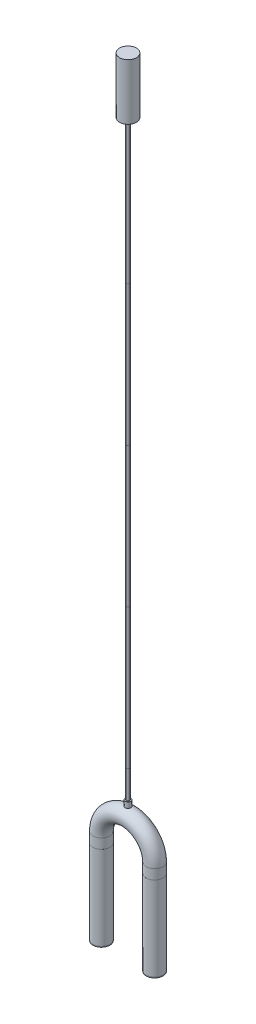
from build123d import *

# Parameters (mm, degrees)
BARRER1_PROFILE_R         = 30
VACIADO1_T                = -3
CROQUIS40_R               = 10
SALIENTE_EXTRUIR3_DEPTH   = 20
CROQUIS41_R               = 6
SALIENTE_EXTRUIR4_DEPTH   = 100
CROQUIS70_R               = 6
SALIENTE_EXTRUIR9_DEPTH   = 500
CROQUIS71_R               = 6
SALIENTE_EXTRUIR10_DEPTH  = 500
CROQUIS72_R               = 6
SALIENTE_EXTRUIR11_DEPTH  = 500
CROQUIS73_R               = 6
SALIENTE_EXTRUIR12_DEPTH  = 500
CROQUIS42_R               = 30
CROQUIS42_R_2             = 27
SALIENTE_EXTRUIR5_DEPTH   = 300
SALIENTE_EXTRUIR5_2_DEPTH = 300
CROQUIS43_R               = 30
SALIENTE_EXTRUIR6_DEPTH   = 3
SALIENTE_EXTRUIR6_2_DEPTH = 3
CROQUIS68_R               = 7.5
SALIENTE_EXTRUIR7_DEPTH   = 10
CROQUIS69_R               = 30
SALIENTE_EXTRUIR8_DEPTH   = 200


with BuildPart() as part:
    # Barrer1: sweep along a path in Croquis1
    with BuildLine(Plane.XY) as barrer1_path:
        Line((-95, 0), (-95, 35))
        ThreePointArc((-95, 35), (0, 130), (95, 35))
        Line((95, 35), (95, 0))
    # Barrer1 profile (on start of the path) → Barrer1 (sweep)
    with BuildSketch(Plane(origin=(-95, 0, 0), x_dir=(0, 0, 1), z_dir=(0, 1, 0))):
        Circle(BARRER1_PROFILE_R)
    sweep(path=barrer1_path.line)

    # Vaciado1
    vaciado1_openings = [part.faces().sort_by_distance(p)[0] for p in [
        (95, 0, 0),
        (-95, 0, 0),
    ]]
    offset(amount=VACIADO1_T, openings=vaciado1_openings, kind=Kind.INTERSECTION)


with BuildPart() as body_2:
    # Croquis40 → Saliente-Extruir3 (new body)
    with BuildSketch(Plane(origin=(0, 160, 0), x_dir=(1, 0, 0), z_dir=(0, 1, 0))):
        with Locations(Location((0, 0, 0), (0, 0, 270))):
            Circle(CROQUIS40_R)
    extrude(amount=SALIENTE_EXTRUIR3_DEPTH)


with BuildPart() as body_3:
    # Croquis41 → Saliente-Extruir4 (new body)
    with BuildSketch(Plane(origin=(0, 180, 0), x_dir=(1, 0, 0), z_dir=(0, 1, 0))):
        with Locations(Location((0, 0, 0), (0, 0, 270))):
            Circle(CROQUIS41_R)
    extrude(amount=SALIENTE_EXTRUIR4_DEPTH)


with BuildPart() as body_4:
    # Croquis70 → Saliente-Extruir9 (new body)
    with BuildSketch(Plane(origin=(0, 280, 0), x_dir=(1, 0, 0), z_dir=(0, 1, 0))):
        with Locations(Location((0, 0, 0), (0, 0, 270))):
            Circle(CROQUIS70_R)
    extrude(amount=SALIENTE_EXTRUIR9_DEPTH)


with BuildPart() as body_5:
    # Croquis71 → Saliente-Extruir10 (new body)
    with BuildSketch(Plane(origin=(0, 780, 0), x_dir=(1, 0, 0), z_dir=(0, 1, 0))):
        with Locations(Location((0, 0, 0), (0, 0, 270))):
            Circle(CROQUIS71_R)
    extrude(amount=SALIENTE_EXTRUIR10_DEPTH)


with BuildPart() as body_6:
    # Croquis72 → Saliente-Extruir11 (new body)
    with BuildSketch(Plane(origin=(0, 1280, 0), x_dir=(1, 0, 0), z_dir=(0, 1, 0))):
        with Locations(Location((0, 0, 0), (0, 0, 270))):
            Circle(CROQUIS72_R)
    extrude(amount=SALIENTE_EXTRUIR11_DEPTH)


with BuildPart() as body_7:
    # Croquis73 → Saliente-Extruir12 (new body)
    with BuildSketch(Plane(origin=(0, 1780, 0), x_dir=(1, 0, 0), z_dir=(0, 1, 0))):
        with Locations(Location((0, 0, 0), (0, 0, 270))):
            Circle(CROQUIS73_R)
    extrude(amount=SALIENTE_EXTRUIR12_DEPTH)


with BuildPart() as body_8:
    # Croquis42 → Saliente-Extruir5 (new body)
    with BuildSketch(Plane.XZ):
        with Locations((95, 0)):
            Circle(CROQUIS42_R)
        with Locations((95, 0)):
            Circle(CROQUIS42_R_2, mode=Mode.SUBTRACT)
    extrude(amount=SALIENTE_EXTRUIR5_DEPTH)


with BuildPart() as body_9:
    # Croquis42 → Saliente-Extruir5 2 (new body)
    with BuildSketch(Plane.XZ):
        with Locations((-95, 0)):
            Circle(CROQUIS42_R)
        with Locations((-95, 0)):
            Circle(CROQUIS42_R_2, mode=Mode.SUBTRACT)
    extrude(amount=SALIENTE_EXTRUIR5_2_DEPTH)


with BuildPart() as body_10:
    # Croquis43 → Saliente-Extruir6 (new body)
    with BuildSketch(Plane.XZ.offset(300)):
        with Locations((-95, 0)):
            Circle(CROQUIS43_R)
    extrude(amount=SALIENTE_EXTRUIR6_DEPTH)


with BuildPart() as body_11:
    # Croquis43 → Saliente-Extruir6 2 (new body)
    with BuildSketch(Plane.XZ.offset(300)):
        with Locations((95, 0)):
            Circle(CROQUIS43_R)
    extrude(amount=SALIENTE_EXTRUIR6_2_DEPTH)


with BuildPart() as body_12:
    # Croquis68 → Saliente-Extruir7 (new body)
    with BuildSketch(Plane(origin=(0, 2280, 0), x_dir=(1, 0, 0), z_dir=(0, 1, 0))):
        with Locations(Location((0, 0, 0), (0, 0, 270))):
            Circle(CROQUIS68_R)
    extrude(amount=SALIENTE_EXTRUIR7_DEPTH)


with BuildPart() as body_13:
    # Croquis69 → Saliente-Extruir8 (new body)
    with BuildSketch(Plane(origin=(0, 2290, 0), x_dir=(1, 0, 0), z_dir=(0, 1, 0))):
        with Locations(Location((0, 0, 0), (0, 0, 270))):
            Circle(CROQUIS69_R)
    extrude(amount=SALIENTE_EXTRUIR8_DEPTH)


solid = Compound([part.part, body_2.part, body_3.part, body_4.part, body_5.part, body_6.part, body_7.part, body_8.part, body_9.part, body_10.part, body_11.part, body_12.part, body_13.part])
